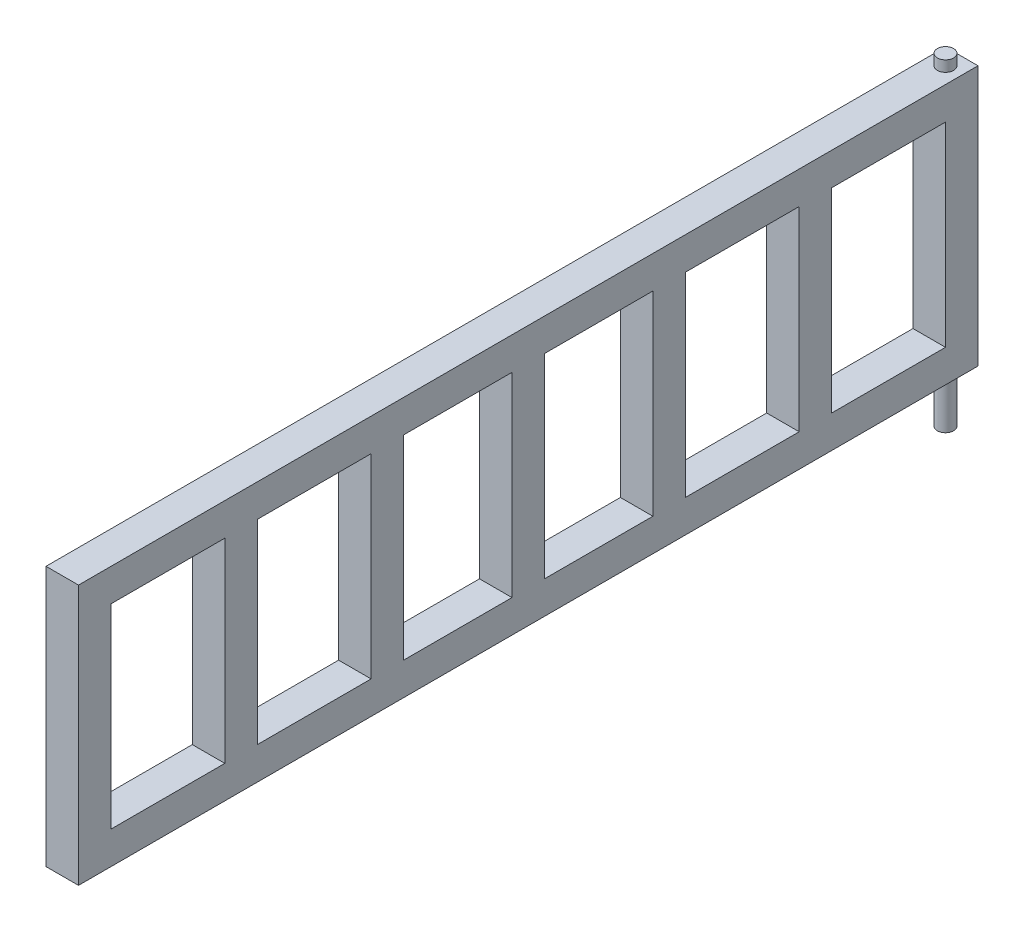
ISO-10303-21;
HEADER;
FILE_DESCRIPTION(('STEP AP214'),'2;1');
FILE_NAME('part.step','',(''),(''),'','','');
FILE_SCHEMA(('AUTOMOTIVE_DESIGN { 1 0 10303 214 1 1 1 1 }'));
ENDSEC;
DATA;
#1=APPLICATION_CONTEXT('core data for automotive mechanical design processes');
#2=APPLICATION_PROTOCOL_DEFINITION('international standard','automotive_design',2000,#1);
#3=PRODUCT_CONTEXT('',#1,'mechanical');
#4=PRODUCT('Part','Part','',(#3));
#5=PRODUCT_RELATED_PRODUCT_CATEGORY('part','',(#4));
#6=PRODUCT_DEFINITION_FORMATION('','',#4);
#7=PRODUCT_DEFINITION_CONTEXT('part definition',#1,'design');
#8=PRODUCT_DEFINITION('design','',#6,#7);
#9=PRODUCT_DEFINITION_SHAPE('','',#8);
#10=(LENGTH_UNIT() NAMED_UNIT(*) SI_UNIT(.MILLI.,.METRE.));
#11=(NAMED_UNIT(*) PLANE_ANGLE_UNIT() SI_UNIT($,.RADIAN.));
#12=(NAMED_UNIT(*) SI_UNIT($,.STERADIAN.) SOLID_ANGLE_UNIT());
#13=UNCERTAINTY_MEASURE_WITH_UNIT(LENGTH_MEASURE(1.E-05),#10,'distance_accuracy_value','');
#14=(GEOMETRIC_REPRESENTATION_CONTEXT(3) GLOBAL_UNCERTAINTY_ASSIGNED_CONTEXT((#13)) GLOBAL_UNIT_ASSIGNED_CONTEXT((#10,
#11,#12)) REPRESENTATION_CONTEXT('',''));
#15=CARTESIAN_POINT('',(0.,0.,0.));
#16=DIRECTION('',(0.,0.,1.));
#17=DIRECTION('',(1.,0.,0.));
#18=AXIS2_PLACEMENT_3D('',#15,#16,#17);
#19=CARTESIAN_POINT('',(0.,-30.,830.));
#20=DIRECTION('',(0.,1.,0.));
#21=DIRECTION('',(0.,0.,1.));
#22=AXIS2_PLACEMENT_3D('',#19,#20,#21);
#23=PLANE('',#22);
#24=DIRECTION('',(1.,0.,0.));
#25=VECTOR('',#24,1.);
#26=CARTESIAN_POINT('',(0.,-30.,0.));
#27=LINE('',#26,#25);
#28=CARTESIAN_POINT('',(0.,-30.,0.));
#29=VERTEX_POINT('',#28);
#30=CARTESIAN_POINT('',(30.,-30.,0.));
#31=VERTEX_POINT('',#30);
#32=EDGE_CURVE('E452',#29,#31,#27,.T.);
#33=ORIENTED_EDGE('',*,*,#32,.T.);
#34=DIRECTION('',(0.,0.,-1.));
#35=VECTOR('',#34,1.);
#36=CARTESIAN_POINT('',(30.,-30.,830.));
#37=LINE('',#36,#35);
#38=CARTESIAN_POINT('',(30.,-30.,830.));
#39=VERTEX_POINT('',#38);
#40=EDGE_CURVE('E408',#39,#31,#37,.T.);
#41=ORIENTED_EDGE('',*,*,#40,.F.);
#42=DIRECTION('',(1.,0.,0.));
#43=VECTOR('',#42,1.);
#44=CARTESIAN_POINT('',(0.,-30.,830.));
#45=LINE('',#44,#43);
#46=CARTESIAN_POINT('',(0.,-30.,830.));
#47=VERTEX_POINT('',#46);
#48=EDGE_CURVE('E456',#47,#39,#45,.T.);
#49=ORIENTED_EDGE('',*,*,#48,.F.);
#50=DIRECTION('',(0.,0.,-1.));
#51=VECTOR('',#50,1.);
#52=CARTESIAN_POINT('',(0.,-30.,830.));
#53=LINE('',#52,#51);
#54=EDGE_CURVE('E392',#47,#29,#53,.T.);
#55=ORIENTED_EDGE('',*,*,#54,.T.);
#56=EDGE_LOOP('',(#33,#41,#49,#55));
#57=FACE_BOUND('',#56,.T.);
#58=CARTESIAN_POINT('',(15.,-30.,15.));
#59=DIRECTION('',(0.,1.,0.));
#60=DIRECTION('',(0.,0.,1.));
#61=AXIS2_PLACEMENT_3D('',#58,#59,#60);
#62=CIRCLE('',#61,7.5);
#63=CARTESIAN_POINT('',(15.,-30.,22.5));
#64=VERTEX_POINT('',#63);
#65=EDGE_CURVE('E11',#64,#64,#62,.F.);
#66=ORIENTED_EDGE('',*,*,#65,.F.);
#67=EDGE_LOOP('',(#66));
#68=FACE_BOUND('',#67,.T.);
#69=ADVANCED_FACE('F37',(#57,#68),#23,.F.);
#70=CARTESIAN_POINT('',(0.,209.999999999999,0.));
#71=DIRECTION('',(0.,-1.,0.));
#72=DIRECTION('',(0.,0.,-1.));
#73=AXIS2_PLACEMENT_3D('',#70,#71,#72);
#74=PLANE('',#73);
#75=DIRECTION('',(0.,0.,1.));
#76=VECTOR('',#75,1.);
#77=CARTESIAN_POINT('',(0.,209.999999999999,830.));
#78=LINE('',#77,#76);
#79=CARTESIAN_POINT('',(0.,209.999999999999,0.));
#80=VERTEX_POINT('',#79);
#81=CARTESIAN_POINT('',(0.,209.999999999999,830.));
#82=VERTEX_POINT('',#81);
#83=EDGE_CURVE('E359',#80,#82,#78,.T.);
#84=ORIENTED_EDGE('',*,*,#83,.T.);
#85=DIRECTION('',(1.,0.,0.));
#86=VECTOR('',#85,1.);
#87=CARTESIAN_POINT('',(0.,209.999999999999,830.));
#88=LINE('',#87,#86);
#89=CARTESIAN_POINT('',(30.,209.999999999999,830.));
#90=VERTEX_POINT('',#89);
#91=EDGE_CURVE('E364',#82,#90,#88,.T.);
#92=ORIENTED_EDGE('',*,*,#91,.T.);
#93=DIRECTION('',(0.,0.,-1.));
#94=VECTOR('',#93,1.);
#95=CARTESIAN_POINT('',(30.,209.999999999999,830.));
#96=LINE('',#95,#94);
#97=CARTESIAN_POINT('',(30.,209.999999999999,0.));
#98=VERTEX_POINT('',#97);
#99=EDGE_CURVE('E367',#90,#98,#96,.T.);
#100=ORIENTED_EDGE('',*,*,#99,.T.);
#101=DIRECTION('',(-1.,0.,0.));
#102=VECTOR('',#101,1.);
#103=CARTESIAN_POINT('',(0.,209.999999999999,0.));
#104=LINE('',#103,#102);
#105=EDGE_CURVE('E370',#98,#80,#104,.T.);
#106=ORIENTED_EDGE('',*,*,#105,.T.);
#107=EDGE_LOOP('',(#84,#92,#100,#106));
#108=FACE_BOUND('',#107,.T.);
#109=CARTESIAN_POINT('',(15.,209.999999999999,15.));
#110=DIRECTION('',(0.,-1.,0.));
#111=DIRECTION('',(0.,0.,-1.));
#112=AXIS2_PLACEMENT_3D('',#109,#110,#111);
#113=CIRCLE('',#112,7.5);
#114=CARTESIAN_POINT('',(15.,209.999999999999,7.5));
#115=VERTEX_POINT('',#114);
#116=EDGE_CURVE('E45',#115,#115,#113,.F.);
#117=ORIENTED_EDGE('',*,*,#116,.F.);
#118=EDGE_LOOP('',(#117));
#119=FACE_BOUND('',#118,.T.);
#120=ADVANCED_FACE('F520',(#108,#119),#74,.F.);
#121=CARTESIAN_POINT('',(0.,0.,830.));
#122=DIRECTION('',(0.,-1.,0.));
#123=DIRECTION('',(0.,0.,-1.));
#124=AXIS2_PLACEMENT_3D('',#121,#122,#123);
#125=PLANE('',#124);
#126=DIRECTION('',(1.,0.,0.));
#127=VECTOR('',#126,1.);
#128=CARTESIAN_POINT('',(0.,0.,560.));
#129=LINE('',#128,#127);
#130=CARTESIAN_POINT('',(0.,0.,560.));
#131=VERTEX_POINT('',#130);
#132=CARTESIAN_POINT('',(30.,0.,560.));
#133=VERTEX_POINT('',#132);
#134=EDGE_CURVE('E60',#131,#133,#129,.T.);
#135=ORIENTED_EDGE('',*,*,#134,.F.);
#136=DIRECTION('',(0.,0.,-1.));
#137=VECTOR('',#136,1.);
#138=CARTESIAN_POINT('',(0.,0.,830.));
#139=LINE('',#138,#137);
#140=CARTESIAN_POINT('',(0.,0.,665.));
#141=VERTEX_POINT('',#140);
#142=EDGE_CURVE('E432',#141,#131,#139,.T.);
#143=ORIENTED_EDGE('',*,*,#142,.F.);
#144=DIRECTION('',(-1.,0.,0.));
#145=VECTOR('',#144,1.);
#146=CARTESIAN_POINT('',(0.,0.,665.));
#147=LINE('',#146,#145);
#148=CARTESIAN_POINT('',(30.,0.,665.));
#149=VERTEX_POINT('',#148);
#150=EDGE_CURVE('E328',#149,#141,#147,.T.);
#151=ORIENTED_EDGE('',*,*,#150,.F.);
#152=DIRECTION('',(0.,0.,-1.));
#153=VECTOR('',#152,1.);
#154=CARTESIAN_POINT('',(30.,0.,830.));
#155=LINE('',#154,#153);
#156=EDGE_CURVE('E233',#149,#133,#155,.T.);
#157=ORIENTED_EDGE('',*,*,#156,.T.);
#158=EDGE_LOOP('',(#135,#143,#151,#157));
#159=FACE_BOUND('',#158,.T.);
#160=ADVANCED_FACE('F524',(#159),#125,.F.);
#161=DIRECTION('',(-1.,0.,0.));
#162=VECTOR('',#161,1.);
#163=CARTESIAN_POINT('',(0.,0.,530.));
#164=LINE('',#163,#162);
#165=CARTESIAN_POINT('',(30.,0.,530.));
#166=VERTEX_POINT('',#165);
#167=CARTESIAN_POINT('',(0.,0.,530.));
#168=VERTEX_POINT('',#167);
#169=EDGE_CURVE('E236',#166,#168,#164,.T.);
#170=ORIENTED_EDGE('',*,*,#169,.F.);
#171=CARTESIAN_POINT('',(30.,0.,430.));
#172=VERTEX_POINT('',#171);
#173=EDGE_CURVE('E224',#166,#172,#155,.T.);
#174=ORIENTED_EDGE('',*,*,#173,.T.);
#175=DIRECTION('',(1.,0.,0.));
#176=VECTOR('',#175,1.);
#177=CARTESIAN_POINT('',(0.,0.,430.));
#178=LINE('',#177,#176);
#179=CARTESIAN_POINT('',(0.,0.,430.));
#180=VERTEX_POINT('',#179);
#181=EDGE_CURVE('E256',#180,#172,#178,.T.);
#182=ORIENTED_EDGE('',*,*,#181,.F.);
#183=EDGE_CURVE('E52',#168,#180,#139,.T.);
#184=ORIENTED_EDGE('',*,*,#183,.F.);
#185=EDGE_LOOP('',(#170,#174,#182,#184));
#186=FACE_BOUND('',#185,.T.);
#187=ADVANCED_FACE('F237',(#186),#125,.F.);
#188=CARTESIAN_POINT('',(0.,179.999999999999,0.));
#189=DIRECTION('',(0.,-1.,0.));
#190=DIRECTION('',(0.,0.,-1.));
#191=AXIS2_PLACEMENT_3D('',#188,#189,#190);
#192=PLANE('',#191);
#193=DIRECTION('',(0.,0.,1.));
#194=VECTOR('',#193,1.);
#195=CARTESIAN_POINT('',(0.,179.999999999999,830.));
#196=LINE('',#195,#194);
#197=CARTESIAN_POINT('',(0.,179.999999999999,560.));
#198=VERTEX_POINT('',#197);
#199=CARTESIAN_POINT('',(0.,179.999999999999,665.));
#200=VERTEX_POINT('',#199);
#201=EDGE_CURVE('E355',#198,#200,#196,.T.);
#202=ORIENTED_EDGE('',*,*,#201,.F.);
#203=DIRECTION('',(1.,0.,0.));
#204=VECTOR('',#203,1.);
#205=CARTESIAN_POINT('',(0.,179.999999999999,560.));
#206=LINE('',#205,#204);
#207=CARTESIAN_POINT('',(30.,179.999999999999,560.));
#208=VERTEX_POINT('',#207);
#209=EDGE_CURVE('E240',#198,#208,#206,.T.);
#210=ORIENTED_EDGE('',*,*,#209,.T.);
#211=DIRECTION('',(0.,0.,-1.));
#212=VECTOR('',#211,1.);
#213=CARTESIAN_POINT('',(30.,179.999999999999,830.));
#214=LINE('',#213,#212);
#215=CARTESIAN_POINT('',(30.,179.999999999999,665.));
#216=VERTEX_POINT('',#215);
#217=EDGE_CURVE('E360',#216,#208,#214,.T.);
#218=ORIENTED_EDGE('',*,*,#217,.F.);
#219=DIRECTION('',(-1.,0.,0.));
#220=VECTOR('',#219,1.);
#221=CARTESIAN_POINT('',(0.,179.999999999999,665.));
#222=LINE('',#221,#220);
#223=EDGE_CURVE('E334',#216,#200,#222,.T.);
#224=ORIENTED_EDGE('',*,*,#223,.T.);
#225=EDGE_LOOP('',(#202,#210,#218,#224));
#226=FACE_BOUND('',#225,.T.);
#227=ADVANCED_FACE('F554',(#226),#192,.T.);
#228=CARTESIAN_POINT('',(30.,179.999999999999,530.));
#229=VERTEX_POINT('',#228);
#230=CARTESIAN_POINT('',(30.,179.999999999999,430.));
#231=VERTEX_POINT('',#230);
#232=EDGE_CURVE('E361',#229,#231,#214,.T.);
#233=ORIENTED_EDGE('',*,*,#232,.F.);
#234=DIRECTION('',(-1.,0.,0.));
#235=VECTOR('',#234,1.);
#236=CARTESIAN_POINT('',(0.,179.999999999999,530.));
#237=LINE('',#236,#235);
#238=CARTESIAN_POINT('',(0.,179.999999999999,530.));
#239=VERTEX_POINT('',#238);
#240=EDGE_CURVE('E244',#229,#239,#237,.T.);
#241=ORIENTED_EDGE('',*,*,#240,.T.);
#242=CARTESIAN_POINT('',(0.,179.999999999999,430.));
#243=VERTEX_POINT('',#242);
#244=EDGE_CURVE('E484',#243,#239,#196,.T.);
#245=ORIENTED_EDGE('',*,*,#244,.F.);
#246=DIRECTION('',(1.,0.,0.));
#247=VECTOR('',#246,1.);
#248=CARTESIAN_POINT('',(0.,179.999999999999,430.));
#249=LINE('',#248,#247);
#250=EDGE_CURVE('E261',#243,#231,#249,.T.);
#251=ORIENTED_EDGE('',*,*,#250,.T.);
#252=EDGE_LOOP('',(#233,#241,#245,#251));
#253=FACE_BOUND('',#252,.T.);
#254=ADVANCED_FACE('F498',(#253),#192,.T.);
#255=DIRECTION('',(-1.,0.,0.));
#256=VECTOR('',#255,1.);
#257=CARTESIAN_POINT('',(0.,0.,400.));
#258=LINE('',#257,#256);
#259=CARTESIAN_POINT('',(30.,0.,400.));
#260=VERTEX_POINT('',#259);
#261=CARTESIAN_POINT('',(0.,0.,400.));
#262=VERTEX_POINT('',#261);
#263=EDGE_CURVE('E258',#260,#262,#258,.T.);
#264=ORIENTED_EDGE('',*,*,#263,.F.);
#265=CARTESIAN_POINT('',(30.,0.,300.));
#266=VERTEX_POINT('',#265);
#267=EDGE_CURVE('E234',#260,#266,#155,.T.);
#268=ORIENTED_EDGE('',*,*,#267,.T.);
#269=DIRECTION('',(1.,0.,0.));
#270=VECTOR('',#269,1.);
#271=CARTESIAN_POINT('',(0.,0.,300.));
#272=LINE('',#271,#270);
#273=CARTESIAN_POINT('',(0.,0.,300.));
#274=VERTEX_POINT('',#273);
#275=EDGE_CURVE('E277',#274,#266,#272,.T.);
#276=ORIENTED_EDGE('',*,*,#275,.F.);
#277=EDGE_CURVE('E430',#262,#274,#139,.T.);
#278=ORIENTED_EDGE('',*,*,#277,.F.);
#279=EDGE_LOOP('',(#264,#268,#276,#278));
#280=FACE_BOUND('',#279,.T.);
#281=ADVANCED_FACE('F710',(#280),#125,.F.);
#282=CARTESIAN_POINT('',(30.,179.999999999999,400.));
#283=VERTEX_POINT('',#282);
#284=CARTESIAN_POINT('',(30.,179.999999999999,300.));
#285=VERTEX_POINT('',#284);
#286=EDGE_CURVE('E890',#283,#285,#214,.T.);
#287=ORIENTED_EDGE('',*,*,#286,.F.);
#288=DIRECTION('',(-1.,0.,0.));
#289=VECTOR('',#288,1.);
#290=CARTESIAN_POINT('',(0.,179.999999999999,400.));
#291=LINE('',#290,#289);
#292=CARTESIAN_POINT('',(0.,179.999999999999,400.));
#293=VERTEX_POINT('',#292);
#294=EDGE_CURVE('E264',#283,#293,#291,.T.);
#295=ORIENTED_EDGE('',*,*,#294,.T.);
#296=CARTESIAN_POINT('',(0.,179.999999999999,300.));
#297=VERTEX_POINT('',#296);
#298=EDGE_CURVE('E482',#297,#293,#196,.T.);
#299=ORIENTED_EDGE('',*,*,#298,.F.);
#300=DIRECTION('',(1.,0.,0.));
#301=VECTOR('',#300,1.);
#302=CARTESIAN_POINT('',(0.,179.999999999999,300.));
#303=LINE('',#302,#301);
#304=EDGE_CURVE('E283',#297,#285,#303,.T.);
#305=ORIENTED_EDGE('',*,*,#304,.T.);
#306=EDGE_LOOP('',(#287,#295,#299,#305));
#307=FACE_BOUND('',#306,.T.);
#308=ADVANCED_FACE('F704',(#307),#192,.T.);
#309=DIRECTION('',(-1.,0.,0.));
#310=VECTOR('',#309,1.);
#311=CARTESIAN_POINT('',(0.,0.,270.));
#312=LINE('',#311,#310);
#313=CARTESIAN_POINT('',(30.,0.,270.));
#314=VERTEX_POINT('',#313);
#315=CARTESIAN_POINT('',(0.,0.,270.));
#316=VERTEX_POINT('',#315);
#317=EDGE_CURVE('E280',#314,#316,#312,.T.);
#318=ORIENTED_EDGE('',*,*,#317,.F.);
#319=CARTESIAN_POINT('',(30.,0.,165.));
#320=VERTEX_POINT('',#319);
#321=EDGE_CURVE('E425',#314,#320,#155,.T.);
#322=ORIENTED_EDGE('',*,*,#321,.T.);
#323=DIRECTION('',(1.,0.,0.));
#324=VECTOR('',#323,1.);
#325=CARTESIAN_POINT('',(0.,0.,165.));
#326=LINE('',#325,#324);
#327=CARTESIAN_POINT('',(0.,0.,165.));
#328=VERTEX_POINT('',#327);
#329=EDGE_CURVE('E301',#328,#320,#326,.T.);
#330=ORIENTED_EDGE('',*,*,#329,.F.);
#331=EDGE_CURVE('E429',#316,#328,#139,.T.);
#332=ORIENTED_EDGE('',*,*,#331,.F.);
#333=EDGE_LOOP('',(#318,#322,#330,#332));
#334=FACE_BOUND('',#333,.T.);
#335=ADVANCED_FACE('F474',(#334),#125,.F.);
#336=CARTESIAN_POINT('',(30.,179.999999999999,270.));
#337=VERTEX_POINT('',#336);
#338=CARTESIAN_POINT('',(30.,179.999999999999,165.));
#339=VERTEX_POINT('',#338);
#340=EDGE_CURVE('E481',#337,#339,#214,.T.);
#341=ORIENTED_EDGE('',*,*,#340,.F.);
#342=DIRECTION('',(-1.,0.,0.));
#343=VECTOR('',#342,1.);
#344=CARTESIAN_POINT('',(0.,179.999999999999,270.));
#345=LINE('',#344,#343);
#346=CARTESIAN_POINT('',(0.,179.999999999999,270.));
#347=VERTEX_POINT('',#346);
#348=EDGE_CURVE('E286',#337,#347,#345,.T.);
#349=ORIENTED_EDGE('',*,*,#348,.T.);
#350=CARTESIAN_POINT('',(0.,179.999999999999,165.));
#351=VERTEX_POINT('',#350);
#352=EDGE_CURVE('E354',#351,#347,#196,.T.);
#353=ORIENTED_EDGE('',*,*,#352,.F.);
#354=DIRECTION('',(1.,0.,0.));
#355=VECTOR('',#354,1.);
#356=CARTESIAN_POINT('',(0.,179.999999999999,165.));
#357=LINE('',#356,#355);
#358=EDGE_CURVE('E307',#351,#339,#357,.T.);
#359=ORIENTED_EDGE('',*,*,#358,.T.);
#360=EDGE_LOOP('',(#341,#349,#353,#359));
#361=FACE_BOUND('',#360,.T.);
#362=ADVANCED_FACE('F480',(#361),#192,.T.);
#363=DIRECTION('',(-1.,0.,0.));
#364=VECTOR('',#363,1.);
#365=CARTESIAN_POINT('',(0.,0.,135.));
#366=LINE('',#365,#364);
#367=CARTESIAN_POINT('',(30.,0.,135.));
#368=VERTEX_POINT('',#367);
#369=CARTESIAN_POINT('',(0.,0.,135.));
#370=VERTEX_POINT('',#369);
#371=EDGE_CURVE('E304',#368,#370,#366,.T.);
#372=ORIENTED_EDGE('',*,*,#371,.F.);
#373=CARTESIAN_POINT('',(30.,0.,30.));
#374=VERTEX_POINT('',#373);
#375=EDGE_CURVE('E422',#368,#374,#155,.T.);
#376=ORIENTED_EDGE('',*,*,#375,.T.);
#377=DIRECTION('',(1.,0.,0.));
#378=VECTOR('',#377,1.);
#379=CARTESIAN_POINT('',(0.,0.,30.));
#380=LINE('',#379,#378);
#381=CARTESIAN_POINT('',(0.,0.,30.));
#382=VERTEX_POINT('',#381);
#383=EDGE_CURVE('E383',#382,#374,#380,.T.);
#384=ORIENTED_EDGE('',*,*,#383,.F.);
#385=EDGE_CURVE('E460',#370,#382,#139,.T.);
#386=ORIENTED_EDGE('',*,*,#385,.F.);
#387=EDGE_LOOP('',(#372,#376,#384,#386));
#388=FACE_BOUND('',#387,.T.);
#389=ADVANCED_FACE('F537',(#388),#125,.F.);
#390=CARTESIAN_POINT('',(30.,179.999999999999,135.));
#391=VERTEX_POINT('',#390);
#392=CARTESIAN_POINT('',(30.,179.999999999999,30.));
#393=VERTEX_POINT('',#392);
#394=EDGE_CURVE('E353',#391,#393,#214,.T.);
#395=ORIENTED_EDGE('',*,*,#394,.F.);
#396=DIRECTION('',(-1.,0.,0.));
#397=VECTOR('',#396,1.);
#398=CARTESIAN_POINT('',(0.,179.999999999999,135.));
#399=LINE('',#398,#397);
#400=CARTESIAN_POINT('',(0.,179.999999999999,135.));
#401=VERTEX_POINT('',#400);
#402=EDGE_CURVE('E310',#391,#401,#399,.T.);
#403=ORIENTED_EDGE('',*,*,#402,.T.);
#404=CARTESIAN_POINT('',(0.,179.999999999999,30.));
#405=VERTEX_POINT('',#404);
#406=EDGE_CURVE('E350',#405,#401,#196,.T.);
#407=ORIENTED_EDGE('',*,*,#406,.F.);
#408=DIRECTION('',(1.,0.,0.));
#409=VECTOR('',#408,1.);
#410=CARTESIAN_POINT('',(0.,179.999999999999,30.));
#411=LINE('',#410,#409);
#412=EDGE_CURVE('E386',#405,#393,#411,.T.);
#413=ORIENTED_EDGE('',*,*,#412,.T.);
#414=EDGE_LOOP('',(#395,#403,#407,#413));
#415=FACE_BOUND('',#414,.T.);
#416=ADVANCED_FACE('F535',(#415),#192,.T.);
#417=DIRECTION('',(1.,0.,0.));
#418=VECTOR('',#417,1.);
#419=CARTESIAN_POINT('',(0.,0.,695.));
#420=LINE('',#419,#418);
#421=CARTESIAN_POINT('',(0.,0.,695.));
#422=VERTEX_POINT('',#421);
#423=CARTESIAN_POINT('',(30.,0.,695.));
#424=VERTEX_POINT('',#423);
#425=EDGE_CURVE('E325',#422,#424,#420,.T.);
#426=ORIENTED_EDGE('',*,*,#425,.F.);
#427=CARTESIAN_POINT('',(0.,0.,800.));
#428=VERTEX_POINT('',#427);
#429=EDGE_CURVE('E409',#428,#422,#139,.T.);
#430=ORIENTED_EDGE('',*,*,#429,.F.);
#431=DIRECTION('',(-1.,0.,0.));
#432=VECTOR('',#431,1.);
#433=CARTESIAN_POINT('',(0.,0.,800.));
#434=LINE('',#433,#432);
#435=CARTESIAN_POINT('',(30.,0.,800.));
#436=VERTEX_POINT('',#435);
#437=EDGE_CURVE('E373',#436,#428,#434,.T.);
#438=ORIENTED_EDGE('',*,*,#437,.F.);
#439=EDGE_CURVE('E405',#436,#424,#155,.T.);
#440=ORIENTED_EDGE('',*,*,#439,.T.);
#441=EDGE_LOOP('',(#426,#430,#438,#440));
#442=FACE_BOUND('',#441,.T.);
#443=ADVANCED_FACE('F531',(#442),#125,.F.);
#444=CARTESIAN_POINT('',(0.,179.999999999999,695.));
#445=VERTEX_POINT('',#444);
#446=CARTESIAN_POINT('',(0.,179.999999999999,800.));
#447=VERTEX_POINT('',#446);
#448=EDGE_CURVE('E349',#445,#447,#196,.T.);
#449=ORIENTED_EDGE('',*,*,#448,.F.);
#450=DIRECTION('',(1.,0.,0.));
#451=VECTOR('',#450,1.);
#452=CARTESIAN_POINT('',(0.,179.999999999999,695.));
#453=LINE('',#452,#451);
#454=CARTESIAN_POINT('',(30.,179.999999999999,695.));
#455=VERTEX_POINT('',#454);
#456=EDGE_CURVE('E331',#445,#455,#453,.T.);
#457=ORIENTED_EDGE('',*,*,#456,.T.);
#458=CARTESIAN_POINT('',(30.,179.999999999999,800.));
#459=VERTEX_POINT('',#458);
#460=EDGE_CURVE('E356',#459,#455,#214,.T.);
#461=ORIENTED_EDGE('',*,*,#460,.F.);
#462=DIRECTION('',(-1.,0.,0.));
#463=VECTOR('',#462,1.);
#464=CARTESIAN_POINT('',(0.,179.999999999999,800.));
#465=LINE('',#464,#463);
#466=EDGE_CURVE('E375',#459,#447,#465,.T.);
#467=ORIENTED_EDGE('',*,*,#466,.T.);
#468=EDGE_LOOP('',(#449,#457,#461,#467));
#469=FACE_BOUND('',#468,.T.);
#470=ADVANCED_FACE('F534',(#469),#192,.T.);
#471=CARTESIAN_POINT('',(0.,0.,830.));
#472=DIRECTION('',(1.,0.,0.));
#473=DIRECTION('',(0.,0.,-1.));
#474=AXIS2_PLACEMENT_3D('',#471,#472,#473);
#475=PLANE('',#474);
#476=DIRECTION('',(0.,-1.,0.));
#477=VECTOR('',#476,1.);
#478=CARTESIAN_POINT('',(0.,179.999999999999,560.));
#479=LINE('',#478,#477);
#480=EDGE_CURVE('E249',#198,#131,#479,.T.);
#481=ORIENTED_EDGE('',*,*,#480,.F.);
#482=ORIENTED_EDGE('',*,*,#201,.T.);
#483=DIRECTION('',(0.,-1.,0.));
#484=VECTOR('',#483,1.);
#485=CARTESIAN_POINT('',(0.,179.999999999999,665.));
#486=LINE('',#485,#484);
#487=EDGE_CURVE('E337',#200,#141,#486,.T.);
#488=ORIENTED_EDGE('',*,*,#487,.T.);
#489=ORIENTED_EDGE('',*,*,#142,.T.);
#490=EDGE_LOOP('',(#481,#482,#488,#489));
#491=FACE_BOUND('',#490,.T.);
#492=DIRECTION('',(0.,-1.,0.));
#493=VECTOR('',#492,1.);
#494=CARTESIAN_POINT('',(0.,179.999999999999,430.));
#495=LINE('',#494,#493);
#496=EDGE_CURVE('E274',#243,#180,#495,.T.);
#497=ORIENTED_EDGE('',*,*,#496,.F.);
#498=ORIENTED_EDGE('',*,*,#244,.T.);
#499=DIRECTION('',(0.,-1.,0.));
#500=VECTOR('',#499,1.);
#501=CARTESIAN_POINT('',(0.,179.999999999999,530.));
#502=LINE('',#501,#500);
#503=EDGE_CURVE('E246',#239,#168,#502,.T.);
#504=ORIENTED_EDGE('',*,*,#503,.T.);
#505=ORIENTED_EDGE('',*,*,#183,.T.);
#506=EDGE_LOOP('',(#497,#498,#504,#505));
#507=FACE_BOUND('',#506,.T.);
#508=DIRECTION('',(0.,-1.,0.));
#509=VECTOR('',#508,1.);
#510=CARTESIAN_POINT('',(0.,179.999999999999,300.));
#511=LINE('',#510,#509);
#512=EDGE_CURVE('E298',#297,#274,#511,.T.);
#513=ORIENTED_EDGE('',*,*,#512,.F.);
#514=ORIENTED_EDGE('',*,*,#298,.T.);
#515=DIRECTION('',(0.,-1.,0.));
#516=VECTOR('',#515,1.);
#517=CARTESIAN_POINT('',(0.,179.999999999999,400.));
#518=LINE('',#517,#516);
#519=EDGE_CURVE('E267',#293,#262,#518,.T.);
#520=ORIENTED_EDGE('',*,*,#519,.T.);
#521=ORIENTED_EDGE('',*,*,#277,.T.);
#522=EDGE_LOOP('',(#513,#514,#520,#521));
#523=FACE_BOUND('',#522,.T.);
#524=DIRECTION('',(0.,-1.,0.));
#525=VECTOR('',#524,1.);
#526=CARTESIAN_POINT('',(0.,179.999999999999,165.));
#527=LINE('',#526,#525);
#528=EDGE_CURVE('E322',#351,#328,#527,.T.);
#529=ORIENTED_EDGE('',*,*,#528,.F.);
#530=ORIENTED_EDGE('',*,*,#352,.T.);
#531=DIRECTION('',(0.,-1.,0.));
#532=VECTOR('',#531,1.);
#533=CARTESIAN_POINT('',(0.,179.999999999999,270.));
#534=LINE('',#533,#532);
#535=EDGE_CURVE('E289',#347,#316,#534,.T.);
#536=ORIENTED_EDGE('',*,*,#535,.T.);
#537=ORIENTED_EDGE('',*,*,#331,.T.);
#538=EDGE_LOOP('',(#529,#530,#536,#537));
#539=FACE_BOUND('',#538,.T.);
#540=ORIENTED_EDGE('',*,*,#429,.T.);
#541=DIRECTION('',(0.,-1.,0.));
#542=VECTOR('',#541,1.);
#543=CARTESIAN_POINT('',(0.,179.999999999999,695.));
#544=LINE('',#543,#542);
#545=EDGE_CURVE('E346',#445,#422,#544,.T.);
#546=ORIENTED_EDGE('',*,*,#545,.F.);
#547=ORIENTED_EDGE('',*,*,#448,.T.);
#548=DIRECTION('',(0.,-1.,0.));
#549=VECTOR('',#548,1.);
#550=CARTESIAN_POINT('',(0.,179.999999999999,800.));
#551=LINE('',#550,#549);
#552=EDGE_CURVE('E378',#447,#428,#551,.T.);
#553=ORIENTED_EDGE('',*,*,#552,.T.);
#554=EDGE_LOOP('',(#540,#546,#547,#553));
#555=FACE_BOUND('',#554,.T.);
#556=DIRECTION('',(0.,-1.,0.));
#557=VECTOR('',#556,1.);
#558=CARTESIAN_POINT('',(0.,179.999999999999,30.));
#559=LINE('',#558,#557);
#560=EDGE_CURVE('E397',#405,#382,#559,.T.);
#561=ORIENTED_EDGE('',*,*,#560,.F.);
#562=ORIENTED_EDGE('',*,*,#406,.T.);
#563=DIRECTION('',(0.,-1.,0.));
#564=VECTOR('',#563,1.);
#565=CARTESIAN_POINT('',(0.,179.999999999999,135.));
#566=LINE('',#565,#564);
#567=EDGE_CURVE('E313',#401,#370,#566,.T.);
#568=ORIENTED_EDGE('',*,*,#567,.T.);
#569=ORIENTED_EDGE('',*,*,#385,.T.);
#570=EDGE_LOOP('',(#561,#562,#568,#569));
#571=FACE_BOUND('',#570,.T.);
#572=DIRECTION('',(0.,-1.,0.));
#573=VECTOR('',#572,1.);
#574=CARTESIAN_POINT('',(0.,0.,0.));
#575=LINE('',#574,#573);
#576=EDGE_CURVE('E402',#80,#29,#575,.T.);
#577=ORIENTED_EDGE('',*,*,#576,.T.);
#578=ORIENTED_EDGE('',*,*,#54,.F.);
#579=DIRECTION('',(0.,-1.,0.));
#580=VECTOR('',#579,1.);
#581=CARTESIAN_POINT('',(0.,0.,830.));
#582=LINE('',#581,#580);
#583=EDGE_CURVE('E453',#82,#47,#582,.T.);
#584=ORIENTED_EDGE('',*,*,#583,.F.);
#585=ORIENTED_EDGE('',*,*,#83,.F.);
#586=EDGE_LOOP('',(#577,#578,#584,#585));
#587=FACE_BOUND('',#586,.T.);
#588=ADVANCED_FACE('F39',(#491,#507,#523,#539,#555,#571,#587),#475,.F.);
#589=CARTESIAN_POINT('',(30.,0.,830.));
#590=DIRECTION('',(-1.,0.,0.));
#591=DIRECTION('',(0.,0.,1.));
#592=AXIS2_PLACEMENT_3D('',#589,#590,#591);
#593=PLANE('',#592);
#594=DIRECTION('',(0.,-1.,0.));
#595=VECTOR('',#594,1.);
#596=CARTESIAN_POINT('',(30.,179.999999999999,530.));
#597=LINE('',#596,#595);
#598=EDGE_CURVE('E228',#229,#166,#597,.T.);
#599=ORIENTED_EDGE('',*,*,#598,.F.);
#600=ORIENTED_EDGE('',*,*,#232,.T.);
#601=DIRECTION('',(0.,-1.,0.));
#602=VECTOR('',#601,1.);
#603=CARTESIAN_POINT('',(30.,179.999999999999,430.));
#604=LINE('',#603,#602);
#605=EDGE_CURVE('E231',#231,#172,#604,.T.);
#606=ORIENTED_EDGE('',*,*,#605,.T.);
#607=ORIENTED_EDGE('',*,*,#173,.F.);
#608=EDGE_LOOP('',(#599,#600,#606,#607));
#609=FACE_BOUND('',#608,.T.);
#610=DIRECTION('',(0.,-1.,0.));
#611=VECTOR('',#610,1.);
#612=CARTESIAN_POINT('',(30.,179.999999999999,400.));
#613=LINE('',#612,#611);
#614=EDGE_CURVE('E270',#283,#260,#613,.T.);
#615=ORIENTED_EDGE('',*,*,#614,.F.);
#616=ORIENTED_EDGE('',*,*,#286,.T.);
#617=DIRECTION('',(0.,-1.,0.));
#618=VECTOR('',#617,1.);
#619=CARTESIAN_POINT('',(30.,179.999999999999,300.));
#620=LINE('',#619,#618);
#621=EDGE_CURVE('E295',#285,#266,#620,.T.);
#622=ORIENTED_EDGE('',*,*,#621,.T.);
#623=ORIENTED_EDGE('',*,*,#267,.F.);
#624=EDGE_LOOP('',(#615,#616,#622,#623));
#625=FACE_BOUND('',#624,.T.);
#626=DIRECTION('',(0.,-1.,0.));
#627=VECTOR('',#626,1.);
#628=CARTESIAN_POINT('',(30.,179.999999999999,270.));
#629=LINE('',#628,#627);
#630=EDGE_CURVE('E292',#337,#314,#629,.T.);
#631=ORIENTED_EDGE('',*,*,#630,.F.);
#632=ORIENTED_EDGE('',*,*,#340,.T.);
#633=DIRECTION('',(0.,-1.,0.));
#634=VECTOR('',#633,1.);
#635=CARTESIAN_POINT('',(30.,179.999999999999,165.));
#636=LINE('',#635,#634);
#637=EDGE_CURVE('E319',#339,#320,#636,.T.);
#638=ORIENTED_EDGE('',*,*,#637,.T.);
#639=ORIENTED_EDGE('',*,*,#321,.F.);
#640=EDGE_LOOP('',(#631,#632,#638,#639));
#641=FACE_BOUND('',#640,.T.);
#642=DIRECTION('',(0.,-1.,0.));
#643=VECTOR('',#642,1.);
#644=CARTESIAN_POINT('',(30.,179.999999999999,135.));
#645=LINE('',#644,#643);
#646=EDGE_CURVE('E316',#391,#368,#645,.T.);
#647=ORIENTED_EDGE('',*,*,#646,.F.);
#648=ORIENTED_EDGE('',*,*,#394,.T.);
#649=DIRECTION('',(0.,-1.,0.));
#650=VECTOR('',#649,1.);
#651=CARTESIAN_POINT('',(30.,179.999999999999,30.));
#652=LINE('',#651,#650);
#653=EDGE_CURVE('E394',#393,#374,#652,.T.);
#654=ORIENTED_EDGE('',*,*,#653,.T.);
#655=ORIENTED_EDGE('',*,*,#375,.F.);
#656=EDGE_LOOP('',(#647,#648,#654,#655));
#657=FACE_BOUND('',#656,.T.);
#658=ORIENTED_EDGE('',*,*,#156,.F.);
#659=DIRECTION('',(0.,-1.,0.));
#660=VECTOR('',#659,1.);
#661=CARTESIAN_POINT('',(30.,179.999999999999,665.));
#662=LINE('',#661,#660);
#663=EDGE_CURVE('E340',#216,#149,#662,.T.);
#664=ORIENTED_EDGE('',*,*,#663,.F.);
#665=ORIENTED_EDGE('',*,*,#217,.T.);
#666=DIRECTION('',(0.,-1.,0.));
#667=VECTOR('',#666,1.);
#668=CARTESIAN_POINT('',(30.,179.999999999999,560.));
#669=LINE('',#668,#667);
#670=EDGE_CURVE('E245',#208,#133,#669,.T.);
#671=ORIENTED_EDGE('',*,*,#670,.T.);
#672=EDGE_LOOP('',(#658,#664,#665,#671));
#673=FACE_BOUND('',#672,.T.);
#674=DIRECTION('',(0.,1.,0.));
#675=VECTOR('',#674,1.);
#676=CARTESIAN_POINT('',(30.,0.,0.));
#677=LINE('',#676,#675);
#678=EDGE_CURVE('E447',#31,#98,#677,.T.);
#679=ORIENTED_EDGE('',*,*,#678,.T.);
#680=ORIENTED_EDGE('',*,*,#99,.F.);
#681=DIRECTION('',(0.,1.,0.));
#682=VECTOR('',#681,1.);
#683=CARTESIAN_POINT('',(30.,0.,830.));
#684=LINE('',#683,#682);
#685=EDGE_CURVE('E448',#39,#90,#684,.T.);
#686=ORIENTED_EDGE('',*,*,#685,.F.);
#687=ORIENTED_EDGE('',*,*,#40,.T.);
#688=EDGE_LOOP('',(#679,#680,#686,#687));
#689=FACE_BOUND('',#688,.T.);
#690=ORIENTED_EDGE('',*,*,#460,.T.);
#691=DIRECTION('',(0.,-1.,0.));
#692=VECTOR('',#691,1.);
#693=CARTESIAN_POINT('',(30.,179.999999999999,695.));
#694=LINE('',#693,#692);
#695=EDGE_CURVE('E343',#455,#424,#694,.T.);
#696=ORIENTED_EDGE('',*,*,#695,.T.);
#697=ORIENTED_EDGE('',*,*,#439,.F.);
#698=DIRECTION('',(0.,-1.,0.));
#699=VECTOR('',#698,1.);
#700=CARTESIAN_POINT('',(30.,179.999999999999,800.));
#701=LINE('',#700,#699);
#702=EDGE_CURVE('E381',#459,#436,#701,.T.);
#703=ORIENTED_EDGE('',*,*,#702,.F.);
#704=EDGE_LOOP('',(#690,#696,#697,#703));
#705=FACE_BOUND('',#704,.T.);
#706=ADVANCED_FACE('F225',(#609,#625,#641,#657,#673,#689,#705),#593,.F.);
#707=CARTESIAN_POINT('',(0.,-30.,830.));
#708=DIRECTION('',(0.,0.,1.));
#709=DIRECTION('',(1.,0.,0.));
#710=AXIS2_PLACEMENT_3D('',#707,#708,#709);
#711=PLANE('',#710);
#712=ORIENTED_EDGE('',*,*,#583,.T.);
#713=ORIENTED_EDGE('',*,*,#48,.T.);
#714=ORIENTED_EDGE('',*,*,#685,.T.);
#715=ORIENTED_EDGE('',*,*,#91,.F.);
#716=EDGE_LOOP('',(#712,#713,#714,#715));
#717=FACE_BOUND('',#716,.T.);
#718=ADVANCED_FACE('F530',(#717),#711,.T.);
#719=CARTESIAN_POINT('',(0.,-30.,0.));
#720=DIRECTION('',(0.,0.,1.));
#721=DIRECTION('',(1.,0.,0.));
#722=AXIS2_PLACEMENT_3D('',#719,#720,#721);
#723=PLANE('',#722);
#724=ORIENTED_EDGE('',*,*,#576,.F.);
#725=ORIENTED_EDGE('',*,*,#105,.F.);
#726=ORIENTED_EDGE('',*,*,#678,.F.);
#727=ORIENTED_EDGE('',*,*,#32,.F.);
#728=EDGE_LOOP('',(#724,#725,#726,#727));
#729=FACE_BOUND('',#728,.T.);
#730=ADVANCED_FACE('F451',(#729),#723,.F.);
#731=CARTESIAN_POINT('',(0.,179.999999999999,30.));
#732=DIRECTION('',(0.,0.,-1.));
#733=DIRECTION('',(-1.,0.,0.));
#734=AXIS2_PLACEMENT_3D('',#731,#732,#733);
#735=PLANE('',#734);
#736=ORIENTED_EDGE('',*,*,#383,.T.);
#737=ORIENTED_EDGE('',*,*,#653,.F.);
#738=ORIENTED_EDGE('',*,*,#412,.F.);
#739=ORIENTED_EDGE('',*,*,#560,.T.);
#740=EDGE_LOOP('',(#736,#737,#738,#739));
#741=FACE_BOUND('',#740,.T.);
#742=ADVANCED_FACE('F542',(#741),#735,.F.);
#743=CARTESIAN_POINT('',(0.,179.999999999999,800.));
#744=DIRECTION('',(0.,0.,1.));
#745=DIRECTION('',(1.,0.,0.));
#746=AXIS2_PLACEMENT_3D('',#743,#744,#745);
#747=PLANE('',#746);
#748=ORIENTED_EDGE('',*,*,#437,.T.);
#749=ORIENTED_EDGE('',*,*,#552,.F.);
#750=ORIENTED_EDGE('',*,*,#466,.F.);
#751=ORIENTED_EDGE('',*,*,#702,.T.);
#752=EDGE_LOOP('',(#748,#749,#750,#751));
#753=FACE_BOUND('',#752,.T.);
#754=ADVANCED_FACE('F545',(#753),#747,.F.);
#755=CARTESIAN_POINT('',(0.,179.999999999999,695.));
#756=DIRECTION('',(0.,0.,-1.));
#757=DIRECTION('',(-1.,0.,0.));
#758=AXIS2_PLACEMENT_3D('',#755,#756,#757);
#759=PLANE('',#758);
#760=ORIENTED_EDGE('',*,*,#425,.T.);
#761=ORIENTED_EDGE('',*,*,#695,.F.);
#762=ORIENTED_EDGE('',*,*,#456,.F.);
#763=ORIENTED_EDGE('',*,*,#545,.T.);
#764=EDGE_LOOP('',(#760,#761,#762,#763));
#765=FACE_BOUND('',#764,.T.);
#766=ADVANCED_FACE('F548',(#765),#759,.F.);
#767=CARTESIAN_POINT('',(0.,179.999999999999,665.));
#768=DIRECTION('',(0.,0.,1.));
#769=DIRECTION('',(1.,0.,0.));
#770=AXIS2_PLACEMENT_3D('',#767,#768,#769);
#771=PLANE('',#770);
#772=ORIENTED_EDGE('',*,*,#150,.T.);
#773=ORIENTED_EDGE('',*,*,#487,.F.);
#774=ORIENTED_EDGE('',*,*,#223,.F.);
#775=ORIENTED_EDGE('',*,*,#663,.T.);
#776=EDGE_LOOP('',(#772,#773,#774,#775));
#777=FACE_BOUND('',#776,.T.);
#778=ADVANCED_FACE('F557',(#777),#771,.F.);
#779=CARTESIAN_POINT('',(0.,179.999999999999,165.));
#780=DIRECTION('',(0.,0.,-1.));
#781=DIRECTION('',(-1.,0.,0.));
#782=AXIS2_PLACEMENT_3D('',#779,#780,#781);
#783=PLANE('',#782);
#784=ORIENTED_EDGE('',*,*,#329,.T.);
#785=ORIENTED_EDGE('',*,*,#637,.F.);
#786=ORIENTED_EDGE('',*,*,#358,.F.);
#787=ORIENTED_EDGE('',*,*,#528,.T.);
#788=EDGE_LOOP('',(#784,#785,#786,#787));
#789=FACE_BOUND('',#788,.T.);
#790=ADVANCED_FACE('F477',(#789),#783,.F.);
#791=CARTESIAN_POINT('',(0.,179.999999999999,135.));
#792=DIRECTION('',(0.,0.,1.));
#793=DIRECTION('',(1.,0.,0.));
#794=AXIS2_PLACEMENT_3D('',#791,#792,#793);
#795=PLANE('',#794);
#796=ORIENTED_EDGE('',*,*,#371,.T.);
#797=ORIENTED_EDGE('',*,*,#567,.F.);
#798=ORIENTED_EDGE('',*,*,#402,.F.);
#799=ORIENTED_EDGE('',*,*,#646,.T.);
#800=EDGE_LOOP('',(#796,#797,#798,#799));
#801=FACE_BOUND('',#800,.T.);
#802=ADVANCED_FACE('F564',(#801),#795,.F.);
#803=CARTESIAN_POINT('',(0.,179.999999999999,300.));
#804=DIRECTION('',(0.,0.,-1.));
#805=DIRECTION('',(-1.,0.,0.));
#806=AXIS2_PLACEMENT_3D('',#803,#804,#805);
#807=PLANE('',#806);
#808=ORIENTED_EDGE('',*,*,#275,.T.);
#809=ORIENTED_EDGE('',*,*,#621,.F.);
#810=ORIENTED_EDGE('',*,*,#304,.F.);
#811=ORIENTED_EDGE('',*,*,#512,.T.);
#812=EDGE_LOOP('',(#808,#809,#810,#811));
#813=FACE_BOUND('',#812,.T.);
#814=ADVANCED_FACE('F567',(#813),#807,.F.);
#815=CARTESIAN_POINT('',(0.,179.999999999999,270.));
#816=DIRECTION('',(0.,0.,1.));
#817=DIRECTION('',(1.,0.,0.));
#818=AXIS2_PLACEMENT_3D('',#815,#816,#817);
#819=PLANE('',#818);
#820=ORIENTED_EDGE('',*,*,#317,.T.);
#821=ORIENTED_EDGE('',*,*,#535,.F.);
#822=ORIENTED_EDGE('',*,*,#348,.F.);
#823=ORIENTED_EDGE('',*,*,#630,.T.);
#824=EDGE_LOOP('',(#820,#821,#822,#823));
#825=FACE_BOUND('',#824,.T.);
#826=ADVANCED_FACE('F571',(#825),#819,.F.);
#827=CARTESIAN_POINT('',(0.,179.999999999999,430.));
#828=DIRECTION('',(0.,0.,-1.));
#829=DIRECTION('',(-1.,0.,0.));
#830=AXIS2_PLACEMENT_3D('',#827,#828,#829);
#831=PLANE('',#830);
#832=ORIENTED_EDGE('',*,*,#181,.T.);
#833=ORIENTED_EDGE('',*,*,#605,.F.);
#834=ORIENTED_EDGE('',*,*,#250,.F.);
#835=ORIENTED_EDGE('',*,*,#496,.T.);
#836=EDGE_LOOP('',(#832,#833,#834,#835));
#837=FACE_BOUND('',#836,.T.);
#838=ADVANCED_FACE('F575',(#837),#831,.F.);
#839=CARTESIAN_POINT('',(0.,179.999999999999,400.));
#840=DIRECTION('',(0.,0.,1.));
#841=DIRECTION('',(1.,0.,0.));
#842=AXIS2_PLACEMENT_3D('',#839,#840,#841);
#843=PLANE('',#842);
#844=ORIENTED_EDGE('',*,*,#263,.T.);
#845=ORIENTED_EDGE('',*,*,#519,.F.);
#846=ORIENTED_EDGE('',*,*,#294,.F.);
#847=ORIENTED_EDGE('',*,*,#614,.T.);
#848=EDGE_LOOP('',(#844,#845,#846,#847));
#849=FACE_BOUND('',#848,.T.);
#850=ADVANCED_FACE('F579',(#849),#843,.F.);
#851=CARTESIAN_POINT('',(0.,179.999999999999,560.));
#852=DIRECTION('',(0.,0.,-1.));
#853=DIRECTION('',(-1.,0.,0.));
#854=AXIS2_PLACEMENT_3D('',#851,#852,#853);
#855=PLANE('',#854);
#856=ORIENTED_EDGE('',*,*,#134,.T.);
#857=ORIENTED_EDGE('',*,*,#670,.F.);
#858=ORIENTED_EDGE('',*,*,#209,.F.);
#859=ORIENTED_EDGE('',*,*,#480,.T.);
#860=EDGE_LOOP('',(#856,#857,#858,#859));
#861=FACE_BOUND('',#860,.T.);
#862=ADVANCED_FACE('F583',(#861),#855,.F.);
#863=CARTESIAN_POINT('',(0.,179.999999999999,530.));
#864=DIRECTION('',(0.,0.,1.));
#865=DIRECTION('',(1.,0.,0.));
#866=AXIS2_PLACEMENT_3D('',#863,#864,#865);
#867=PLANE('',#866);
#868=ORIENTED_EDGE('',*,*,#169,.T.);
#869=ORIENTED_EDGE('',*,*,#503,.F.);
#870=ORIENTED_EDGE('',*,*,#240,.F.);
#871=ORIENTED_EDGE('',*,*,#598,.T.);
#872=EDGE_LOOP('',(#868,#869,#870,#871));
#873=FACE_BOUND('',#872,.T.);
#874=ADVANCED_FACE('F242',(#873),#867,.F.);
#875=CARTESIAN_POINT('',(15.,219.999999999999,15.));
#876=DIRECTION('',(0.,-1.,0.));
#877=DIRECTION('',(0.,0.,-1.));
#878=AXIS2_PLACEMENT_3D('',#875,#876,#877);
#879=CYLINDRICAL_SURFACE('',#878,7.5);
#880=CARTESIAN_POINT('',(15.,219.999999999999,15.));
#881=DIRECTION('',(0.,1.,0.));
#882=DIRECTION('',(0.,0.,1.));
#883=AXIS2_PLACEMENT_3D('',#880,#881,#882);
#884=CIRCLE('',#883,7.5);
#885=CARTESIAN_POINT('',(15.,219.999999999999,22.5));
#886=VERTEX_POINT('',#885);
#887=EDGE_CURVE('E503',#886,#886,#884,.T.);
#888=ORIENTED_EDGE('',*,*,#887,.F.);
#889=EDGE_LOOP('',(#888));
#890=FACE_BOUND('',#889,.T.);
#891=ORIENTED_EDGE('',*,*,#116,.T.);
#892=EDGE_LOOP('',(#891));
#893=FACE_BOUND('',#892,.T.);
#894=ADVANCED_FACE('F590',(#890,#893),#879,.T.);
#895=CARTESIAN_POINT('',(15.,219.999999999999,15.));
#896=DIRECTION('',(0.,1.,0.));
#897=DIRECTION('',(0.,0.,1.));
#898=AXIS2_PLACEMENT_3D('',#895,#896,#897);
#899=PLANE('',#898);
#900=ORIENTED_EDGE('',*,*,#887,.T.);
#901=EDGE_LOOP('',(#900));
#902=FACE_BOUND('',#901,.T.);
#903=ADVANCED_FACE('F515',(#902),#899,.T.);
#904=CARTESIAN_POINT('',(15.,-78.,15.));
#905=DIRECTION('',(0.,1.,0.));
#906=DIRECTION('',(0.,0.,1.));
#907=AXIS2_PLACEMENT_3D('',#904,#905,#906);
#908=CYLINDRICAL_SURFACE('',#907,7.5);
#909=CARTESIAN_POINT('',(15.,-78.,15.));
#910=DIRECTION('',(0.,-1.,0.));
#911=DIRECTION('',(0.,0.,-1.));
#912=AXIS2_PLACEMENT_3D('',#909,#910,#911);
#913=CIRCLE('',#912,7.5);
#914=CARTESIAN_POINT('',(15.,-78.,7.5));
#915=VERTEX_POINT('',#914);
#916=EDGE_CURVE('E506',#915,#915,#913,.T.);
#917=ORIENTED_EDGE('',*,*,#916,.F.);
#918=EDGE_LOOP('',(#917));
#919=FACE_BOUND('',#918,.T.);
#920=ORIENTED_EDGE('',*,*,#65,.T.);
#921=EDGE_LOOP('',(#920));
#922=FACE_BOUND('',#921,.T.);
#923=ADVANCED_FACE('F512',(#919,#922),#908,.T.);
#924=CARTESIAN_POINT('',(15.,-78.,15.));
#925=DIRECTION('',(0.,-1.,0.));
#926=DIRECTION('',(0.,0.,-1.));
#927=AXIS2_PLACEMENT_3D('',#924,#925,#926);
#928=PLANE('',#927);
#929=ORIENTED_EDGE('',*,*,#916,.T.);
#930=EDGE_LOOP('',(#929));
#931=FACE_BOUND('',#930,.T.);
#932=ADVANCED_FACE('F510',(#931),#928,.T.);
#933=CLOSED_SHELL('',(#69,#120,#160,#187,#227,#254,#281,#308,#335,#362,#389,#416,#443,#470,#588,
#706,#718,#730,#742,#754,#766,#778,#790,#802,#814,#826,#838,#850,#862,#874,#894,#903,#923,#932));
#934=MANIFOLD_SOLID_BREP('B2',#933);
#935=ADVANCED_BREP_SHAPE_REPRESENTATION('',(#18,#934),#14);
#936=SHAPE_DEFINITION_REPRESENTATION(#9,#935);
ENDSEC;
END-ISO-10303-21;
